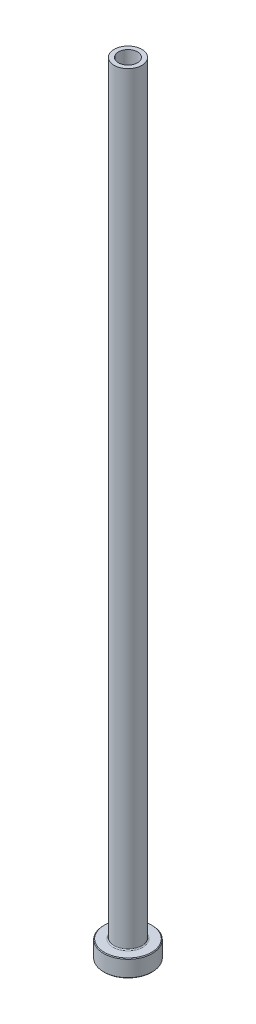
ISO-10303-21;
HEADER;
FILE_DESCRIPTION(('STEP AP214'),'2;1');
FILE_NAME('part.step','',(''),(''),'','','');
FILE_SCHEMA(('AUTOMOTIVE_DESIGN { 1 0 10303 214 1 1 1 1 }'));
ENDSEC;
DATA;
#1=APPLICATION_CONTEXT('core data for automotive mechanical design processes');
#2=APPLICATION_PROTOCOL_DEFINITION('international standard','automotive_design',2000,#1);
#3=PRODUCT_CONTEXT('',#1,'mechanical');
#4=PRODUCT('Part','Part','',(#3));
#5=PRODUCT_RELATED_PRODUCT_CATEGORY('part','',(#4));
#6=PRODUCT_DEFINITION_FORMATION('','',#4);
#7=PRODUCT_DEFINITION_CONTEXT('part definition',#1,'design');
#8=PRODUCT_DEFINITION('design','',#6,#7);
#9=PRODUCT_DEFINITION_SHAPE('','',#8);
#10=(LENGTH_UNIT() NAMED_UNIT(*) SI_UNIT(.MILLI.,.METRE.));
#11=(NAMED_UNIT(*) PLANE_ANGLE_UNIT() SI_UNIT($,.RADIAN.));
#12=(NAMED_UNIT(*) SI_UNIT($,.STERADIAN.) SOLID_ANGLE_UNIT());
#13=UNCERTAINTY_MEASURE_WITH_UNIT(LENGTH_MEASURE(1.E-05),#10,'distance_accuracy_value','');
#14=(GEOMETRIC_REPRESENTATION_CONTEXT(3) GLOBAL_UNCERTAINTY_ASSIGNED_CONTEXT((#13)) GLOBAL_UNIT_ASSIGNED_CONTEXT((#10,
#11,#12)) REPRESENTATION_CONTEXT('',''));
#15=CARTESIAN_POINT('',(0.,0.,0.));
#16=DIRECTION('',(0.,0.,1.));
#17=DIRECTION('',(1.,0.,0.));
#18=AXIS2_PLACEMENT_3D('',#15,#16,#17);
#19=CARTESIAN_POINT('',(0.,92.1876809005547,0.));
#20=DIRECTION('',(0.,1.,0.));
#21=DIRECTION('',(0.,0.,1.));
#22=AXIS2_PLACEMENT_3D('',#19,#20,#21);
#23=CYLINDRICAL_SURFACE('',#22,2.75000000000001);
#24=CARTESIAN_POINT('',(0.,225.,0.));
#25=DIRECTION('',(0.,1.,0.));
#26=DIRECTION('',(0.,0.,1.));
#27=AXIS2_PLACEMENT_3D('',#24,#25,#26);
#28=CIRCLE('',#27,2.75000000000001);
#29=CARTESIAN_POINT('',(0.,225.,2.75000000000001));
#30=VERTEX_POINT('',#29);
#31=EDGE_CURVE('E62',#30,#30,#28,.T.);
#32=ORIENTED_EDGE('',*,*,#31,.T.);
#33=EDGE_LOOP('',(#32));
#34=FACE_BOUND('',#33,.T.);
#35=CARTESIAN_POINT('',(0.,180.,0.));
#36=DIRECTION('',(0.,1.,0.));
#37=DIRECTION('',(0.,0.,1.));
#38=AXIS2_PLACEMENT_3D('',#35,#36,#37);
#39=CIRCLE('',#38,2.75000000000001);
#40=CARTESIAN_POINT('',(0.,180.,2.75000000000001));
#41=VERTEX_POINT('',#40);
#42=EDGE_CURVE('E71',#41,#41,#39,.T.);
#43=ORIENTED_EDGE('',*,*,#42,.F.);
#44=EDGE_LOOP('',(#43));
#45=FACE_BOUND('',#44,.T.);
#46=ADVANCED_FACE('F30',(#34,#45),#23,.F.);
#47=CARTESIAN_POINT('',(-2.75000000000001,225.,0.));
#48=DIRECTION('',(0.,1.,0.));
#49=DIRECTION('',(0.,0.,1.));
#50=AXIS2_PLACEMENT_3D('',#47,#48,#49);
#51=PLANE('',#50);
#52=CARTESIAN_POINT('',(0.,225.,0.));
#53=DIRECTION('',(0.,1.,0.));
#54=DIRECTION('',(0.,0.,1.));
#55=AXIS2_PLACEMENT_3D('',#52,#53,#54);
#56=CIRCLE('',#55,4.00000000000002);
#57=CARTESIAN_POINT('',(0.,225.,4.00000000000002));
#58=VERTEX_POINT('',#57);
#59=EDGE_CURVE('E65',#58,#58,#56,.T.);
#60=ORIENTED_EDGE('',*,*,#59,.T.);
#61=EDGE_LOOP('',(#60));
#62=FACE_BOUND('',#61,.T.);
#63=ORIENTED_EDGE('',*,*,#31,.F.);
#64=EDGE_LOOP('',(#63));
#65=FACE_BOUND('',#64,.T.);
#66=ADVANCED_FACE('F79',(#62,#65),#51,.T.);
#67=CARTESIAN_POINT('',(0.,92.1876809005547,0.));
#68=DIRECTION('',(0.,1.,0.));
#69=DIRECTION('',(0.,0.,1.));
#70=AXIS2_PLACEMENT_3D('',#67,#68,#69);
#71=CYLINDRICAL_SURFACE('',#70,4.);
#72=CARTESIAN_POINT('',(0.,5.3,0.));
#73=DIRECTION('',(0.,1.,0.));
#74=DIRECTION('',(0.,0.,1.));
#75=AXIS2_PLACEMENT_3D('',#72,#73,#74);
#76=CIRCLE('',#75,4.);
#77=CARTESIAN_POINT('',(0.,5.3,4.));
#78=VERTEX_POINT('',#77);
#79=EDGE_CURVE('E59',#78,#78,#76,.T.);
#80=ORIENTED_EDGE('',*,*,#79,.T.);
#81=EDGE_LOOP('',(#80));
#82=FACE_BOUND('',#81,.T.);
#83=ORIENTED_EDGE('',*,*,#59,.F.);
#84=EDGE_LOOP('',(#83));
#85=FACE_BOUND('',#84,.T.);
#86=ADVANCED_FACE('F85',(#82,#85),#71,.T.);
#87=CARTESIAN_POINT('',(-3.99999999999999,5.,0.));
#88=DIRECTION('',(0.,1.,0.));
#89=DIRECTION('',(0.,0.,1.));
#90=AXIS2_PLACEMENT_3D('',#87,#88,#89);
#91=PLANE('',#90);
#92=CARTESIAN_POINT('',(0.,5.,0.));
#93=DIRECTION('',(0.,1.,0.));
#94=DIRECTION('',(0.,0.,1.));
#95=AXIS2_PLACEMENT_3D('',#92,#93,#94);
#96=CIRCLE('',#95,6.79999999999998);
#97=CARTESIAN_POINT('',(0.,5.,6.79999999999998));
#98=VERTEX_POINT('',#97);
#99=EDGE_CURVE('E53',#98,#98,#96,.T.);
#100=ORIENTED_EDGE('',*,*,#99,.T.);
#101=EDGE_LOOP('',(#100));
#102=FACE_BOUND('',#101,.T.);
#103=CARTESIAN_POINT('',(0.,5.,0.));
#104=DIRECTION('',(0.,1.,0.));
#105=DIRECTION('',(0.,0.,1.));
#106=AXIS2_PLACEMENT_3D('',#103,#104,#105);
#107=CIRCLE('',#106,4.3);
#108=CARTESIAN_POINT('',(0.,5.,4.3));
#109=VERTEX_POINT('',#108);
#110=EDGE_CURVE('E56',#109,#109,#107,.F.);
#111=ORIENTED_EDGE('',*,*,#110,.T.);
#112=EDGE_LOOP('',(#111));
#113=FACE_BOUND('',#112,.T.);
#114=ADVANCED_FACE('F111',(#102,#113),#91,.T.);
#115=CARTESIAN_POINT('',(0.,92.1876809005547,0.));
#116=DIRECTION('',(0.,1.,0.));
#117=DIRECTION('',(0.,0.,1.));
#118=AXIS2_PLACEMENT_3D('',#115,#116,#117);
#119=CYLINDRICAL_SURFACE('',#118,6.99999999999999);
#120=CARTESIAN_POINT('',(0.,4.79999999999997,0.));
#121=DIRECTION('',(0.,1.,0.));
#122=DIRECTION('',(0.,0.,1.));
#123=AXIS2_PLACEMENT_3D('',#120,#121,#122);
#124=CIRCLE('',#123,6.99999999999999);
#125=CARTESIAN_POINT('',(0.,4.79999999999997,6.99999999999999));
#126=VERTEX_POINT('',#125);
#127=EDGE_CURVE('E45',#126,#126,#124,.F.);
#128=ORIENTED_EDGE('',*,*,#127,.T.);
#129=EDGE_LOOP('',(#128));
#130=FACE_BOUND('',#129,.T.);
#131=CARTESIAN_POINT('',(0.,0.20000000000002,0.));
#132=DIRECTION('',(0.,-1.,0.));
#133=DIRECTION('',(0.,0.,-1.));
#134=AXIS2_PLACEMENT_3D('',#131,#132,#133);
#135=CIRCLE('',#134,6.99999999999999);
#136=CARTESIAN_POINT('',(0.,0.20000000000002,-6.99999999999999));
#137=VERTEX_POINT('',#136);
#138=EDGE_CURVE('E50',#137,#137,#135,.F.);
#139=ORIENTED_EDGE('',*,*,#138,.T.);
#140=EDGE_LOOP('',(#139));
#141=FACE_BOUND('',#140,.T.);
#142=ADVANCED_FACE('F108',(#130,#141),#119,.T.);
#143=CARTESIAN_POINT('',(-6.99999999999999,0.,0.));
#144=DIRECTION('',(0.,-1.,0.));
#145=DIRECTION('',(0.,0.,-1.));
#146=AXIS2_PLACEMENT_3D('',#143,#144,#145);
#147=PLANE('',#146);
#148=CARTESIAN_POINT('',(0.,0.,0.));
#149=DIRECTION('',(0.,-1.,0.));
#150=DIRECTION('',(0.,0.,-1.));
#151=AXIS2_PLACEMENT_3D('',#148,#149,#150);
#152=CIRCLE('',#151,3.5);
#153=CARTESIAN_POINT('',(0.,0.,-3.5));
#154=VERTEX_POINT('',#153);
#155=EDGE_CURVE('E37',#154,#154,#152,.F.);
#156=ORIENTED_EDGE('',*,*,#155,.T.);
#157=EDGE_LOOP('',(#156));
#158=FACE_BOUND('',#157,.T.);
#159=CARTESIAN_POINT('',(0.,0.,0.));
#160=DIRECTION('',(0.,-1.,0.));
#161=DIRECTION('',(0.,0.,-1.));
#162=AXIS2_PLACEMENT_3D('',#159,#160,#161);
#163=CIRCLE('',#162,6.79999999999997);
#164=CARTESIAN_POINT('',(0.,0.,-6.79999999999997));
#165=VERTEX_POINT('',#164);
#166=EDGE_CURVE('E41',#165,#165,#163,.T.);
#167=ORIENTED_EDGE('',*,*,#166,.T.);
#168=EDGE_LOOP('',(#167));
#169=FACE_BOUND('',#168,.T.);
#170=ADVANCED_FACE('F110',(#158,#169),#147,.T.);
#171=CARTESIAN_POINT('',(0.,92.1876809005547,0.));
#172=DIRECTION('',(0.,1.,0.));
#173=DIRECTION('',(0.,0.,1.));
#174=AXIS2_PLACEMENT_3D('',#171,#172,#173);
#175=CYLINDRICAL_SURFACE('',#174,3.);
#176=CARTESIAN_POINT('',(0.,0.500000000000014,0.));
#177=DIRECTION('',(0.,-1.,0.));
#178=DIRECTION('',(0.,0.,-1.));
#179=AXIS2_PLACEMENT_3D('',#176,#177,#178);
#180=CIRCLE('',#179,3.);
#181=CARTESIAN_POINT('',(0.,0.500000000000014,-3.));
#182=VERTEX_POINT('',#181);
#183=EDGE_CURVE('E10',#182,#182,#180,.T.);
#184=ORIENTED_EDGE('',*,*,#183,.T.);
#185=EDGE_LOOP('',(#184));
#186=FACE_BOUND('',#185,.T.);
#187=CARTESIAN_POINT('',(0.,168.,0.));
#188=DIRECTION('',(0.,1.,0.));
#189=DIRECTION('',(0.,0.,1.));
#190=AXIS2_PLACEMENT_3D('',#187,#188,#189);
#191=CIRCLE('',#190,3.00000000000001);
#192=CARTESIAN_POINT('',(0.,168.,3.00000000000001));
#193=VERTEX_POINT('',#192);
#194=EDGE_CURVE('E68',#193,#193,#191,.T.);
#195=ORIENTED_EDGE('',*,*,#194,.T.);
#196=EDGE_LOOP('',(#195));
#197=FACE_BOUND('',#196,.T.);
#198=ADVANCED_FACE('F118',(#186,#197),#175,.F.);
#199=CARTESIAN_POINT('',(0.,168.,0.));
#200=DIRECTION('',(0.,-1.,0.));
#201=DIRECTION('',(0.,0.,-1.));
#202=AXIS2_PLACEMENT_3D('',#199,#200,#201);
#203=CONICAL_SURFACE('',#202,3.00000000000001,0.0208303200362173);
#204=ORIENTED_EDGE('',*,*,#42,.T.);
#205=EDGE_LOOP('',(#204));
#206=FACE_BOUND('',#205,.T.);
#207=ORIENTED_EDGE('',*,*,#194,.F.);
#208=EDGE_LOOP('',(#207));
#209=FACE_BOUND('',#208,.T.);
#210=ADVANCED_FACE('F75',(#206,#209),#203,.F.);
#211=CARTESIAN_POINT('',(0.,5.3,0.));
#212=DIRECTION('',(0.,1.,0.));
#213=DIRECTION('',(0.,0.,1.));
#214=AXIS2_PLACEMENT_3D('',#211,#212,#213);
#215=TOROIDAL_SURFACE('',#214,4.3,0.3);
#216=ORIENTED_EDGE('',*,*,#110,.F.);
#217=EDGE_LOOP('',(#216));
#218=FACE_BOUND('',#217,.T.);
#219=ORIENTED_EDGE('',*,*,#79,.F.);
#220=EDGE_LOOP('',(#219));
#221=FACE_BOUND('',#220,.T.);
#222=ADVANCED_FACE('F90',(#218,#221),#215,.F.);
#223=CARTESIAN_POINT('',(0.,5.,0.));
#224=DIRECTION('',(0.,-1.,0.));
#225=DIRECTION('',(0.,0.,-1.));
#226=AXIS2_PLACEMENT_3D('',#223,#224,#225);
#227=CONICAL_SURFACE('',#226,6.79999999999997,0.785398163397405);
#228=ORIENTED_EDGE('',*,*,#127,.F.);
#229=EDGE_LOOP('',(#228));
#230=FACE_BOUND('',#229,.T.);
#231=ORIENTED_EDGE('',*,*,#99,.F.);
#232=EDGE_LOOP('',(#231));
#233=FACE_BOUND('',#232,.T.);
#234=ADVANCED_FACE('F93',(#230,#233),#227,.T.);
#235=CARTESIAN_POINT('',(0.,0.20000000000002,0.));
#236=DIRECTION('',(0.,1.,0.));
#237=DIRECTION('',(0.,0.,1.));
#238=AXIS2_PLACEMENT_3D('',#235,#236,#237);
#239=CONICAL_SURFACE('',#238,6.99999999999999,0.78539816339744);
#240=ORIENTED_EDGE('',*,*,#166,.F.);
#241=EDGE_LOOP('',(#240));
#242=FACE_BOUND('',#241,.T.);
#243=ORIENTED_EDGE('',*,*,#138,.F.);
#244=EDGE_LOOP('',(#243));
#245=FACE_BOUND('',#244,.T.);
#246=ADVANCED_FACE('F96',(#242,#245),#239,.T.);
#247=CARTESIAN_POINT('',(0.,0.,0.));
#248=DIRECTION('',(0.,-1.,0.));
#249=DIRECTION('',(0.,0.,-1.));
#250=AXIS2_PLACEMENT_3D('',#247,#248,#249);
#251=CONICAL_SURFACE('',#250,3.5,0.785398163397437);
#252=ORIENTED_EDGE('',*,*,#183,.F.);
#253=EDGE_LOOP('',(#252));
#254=FACE_BOUND('',#253,.T.);
#255=ORIENTED_EDGE('',*,*,#155,.F.);
#256=EDGE_LOOP('',(#255));
#257=FACE_BOUND('',#256,.T.);
#258=ADVANCED_FACE('F32',(#254,#257),#251,.F.);
#259=CLOSED_SHELL('',(#46,#66,#86,#114,#142,#170,#198,#210,#222,#234,#246,#258));
#260=MANIFOLD_SOLID_BREP('B2',#259);
#261=ADVANCED_BREP_SHAPE_REPRESENTATION('',(#18,#260),#14);
#262=SHAPE_DEFINITION_REPRESENTATION(#9,#261);
ENDSEC;
END-ISO-10303-21;
